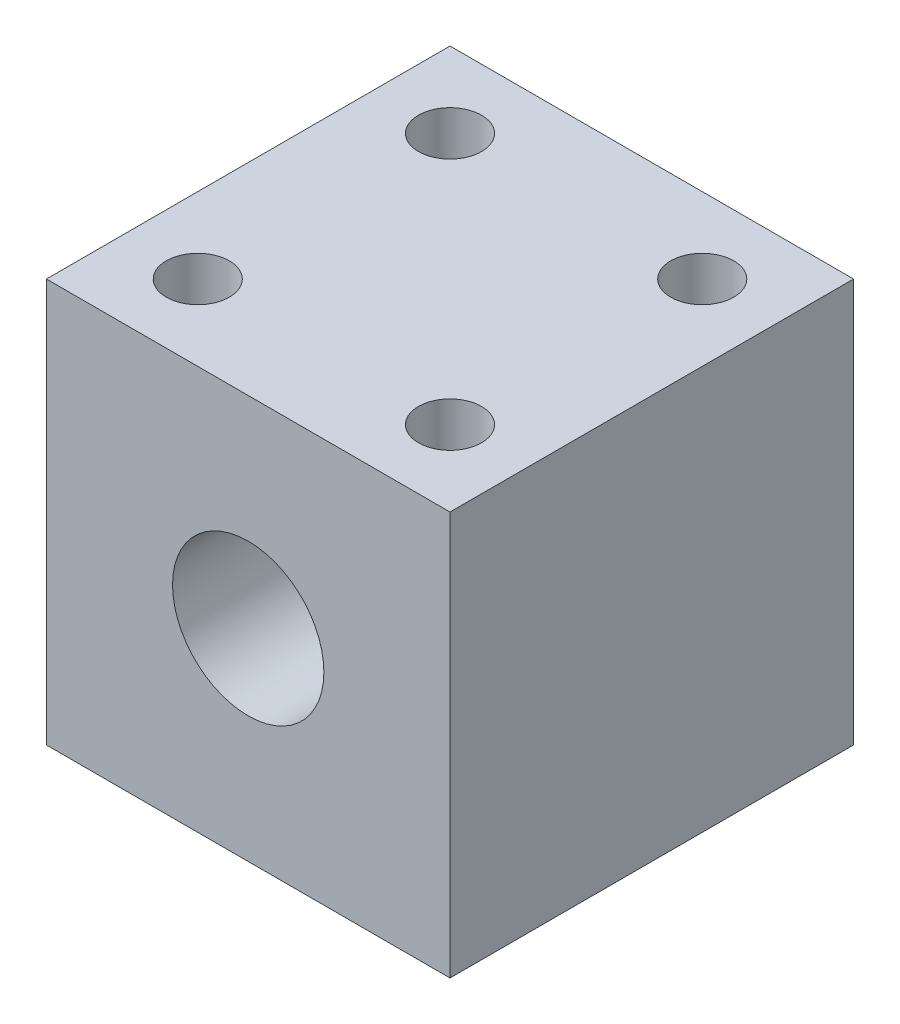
from build123d import *

# Parameters (mm, degrees)
SKETCH_1_W          = 16
SKETCH_1_H          = 16
EXTRUDE_1_DEPTH     = 16
SKETCH_2_R          = 3
CUT_EXTRUDE_1_DEPTH = 16
HOLE_WIZARD_M3_1_D  = 2.5


with BuildPart() as part:
    # Sketch 1 → Extrude 1 (new body)
    with BuildSketch(Plane.XY):
        Rectangle(SKETCH_1_W, SKETCH_1_H)
    extrude(amount=EXTRUDE_1_DEPTH)

    # Sketch 2 → Cut-Extrude 1 (cut)
    with BuildSketch(Plane.XY.offset(16)):
        Circle(SKETCH_2_R)
    extrude(amount=-CUT_EXTRUDE_1_DEPTH, mode=Mode.SUBTRACT)

    # Hole Wizard M3 _1 (through all)
    with Locations(Plane(origin=(0, 8, 0), x_dir=(1, 0, 0), z_dir=(0, 1, 0))):
        with Locations((-5, -13), (-5, -3), (5, -3), (5, -13)):
            Hole(HOLE_WIZARD_M3_1_D / 2)


solid = part.part
